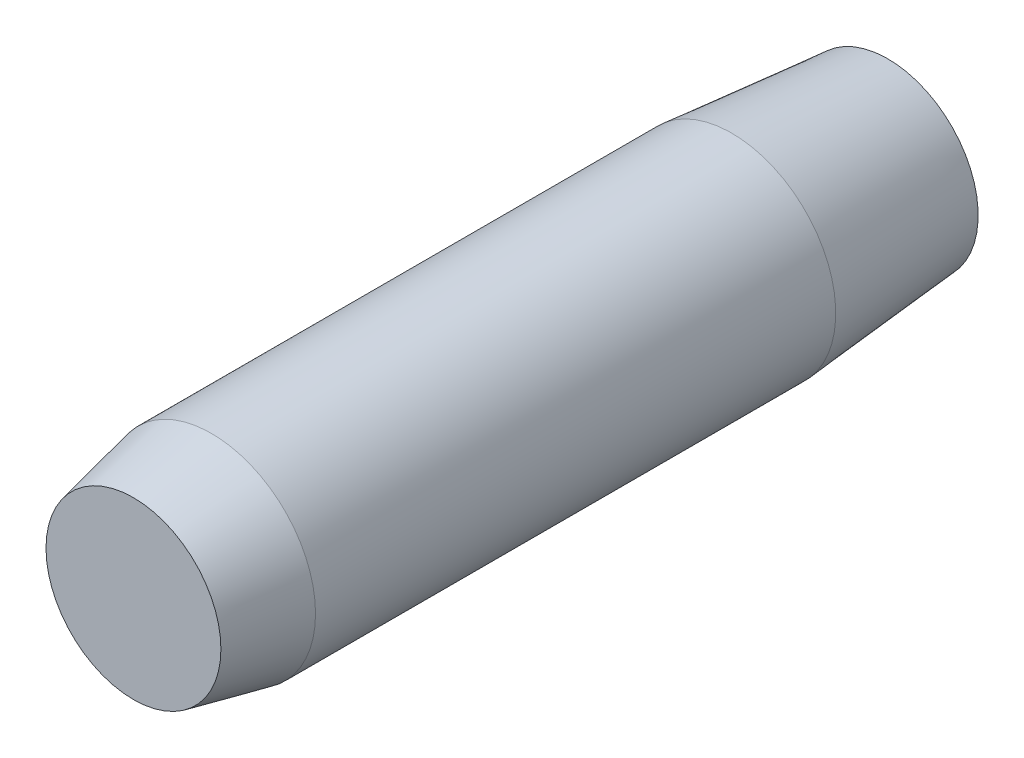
from build123d import *

# Parameters (mm, degrees)
ESQUISSE1_R      = 20
EXTRUSION1_DEPTH = 100
ESQUISSE2_R      = 20
EXTRUSION2_DEPTH = 15
EXTRUSION2_TAPER = 12
ESQUISSE3_R      = 20
EXTRUSION3_DEPTH = 30
EXTRUSION3_TAPER = 5


with BuildPart() as part:
    # Esquisse1 → Extrusion1 (new body)
    with BuildSketch(Plane.XY):
        Circle(ESQUISSE1_R)
    extrude(amount=EXTRUSION1_DEPTH)

    # Esquisse2 → Extrusion2 (add)
    with BuildSketch(Plane.XY.offset(100)):
        Circle(ESQUISSE2_R)
    extrude(amount=EXTRUSION2_DEPTH, taper=EXTRUSION2_TAPER)

    # Esquisse3 → Extrusion3 (add)
    with BuildSketch(Plane(origin=(0, 0, 0), x_dir=(-1, 0, 0), z_dir=(0, 0, -1))):
        Circle(ESQUISSE3_R)
    extrude(amount=EXTRUSION3_DEPTH, taper=EXTRUSION3_TAPER)


solid = part.part
